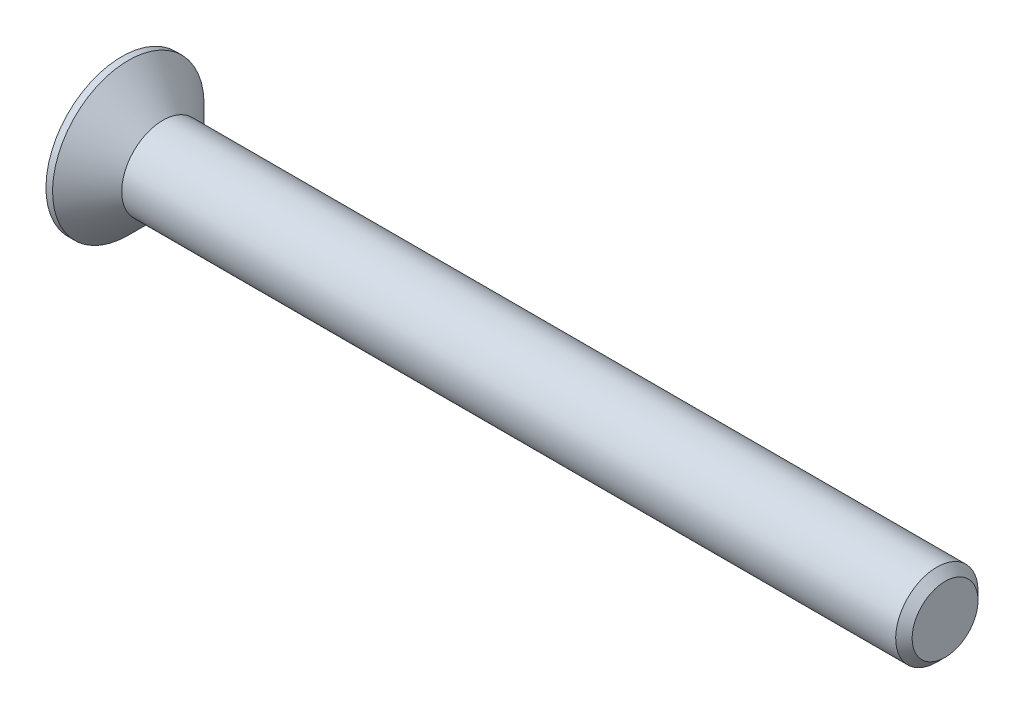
ISO-10303-21;
HEADER;
FILE_DESCRIPTION(('STEP AP214'),'2;1');
FILE_NAME('part.step','',(''),(''),'','','');
FILE_SCHEMA(('AUTOMOTIVE_DESIGN { 1 0 10303 214 1 1 1 1 }'));
ENDSEC;
DATA;
#1=APPLICATION_CONTEXT('core data for automotive mechanical design processes');
#2=APPLICATION_PROTOCOL_DEFINITION('international standard','automotive_design',2000,#1);
#3=PRODUCT_CONTEXT('',#1,'mechanical');
#4=PRODUCT('Part','Part','',(#3));
#5=PRODUCT_RELATED_PRODUCT_CATEGORY('part','',(#4));
#6=PRODUCT_DEFINITION_FORMATION('','',#4);
#7=PRODUCT_DEFINITION_CONTEXT('part definition',#1,'design');
#8=PRODUCT_DEFINITION('design','',#6,#7);
#9=PRODUCT_DEFINITION_SHAPE('','',#8);
#10=(LENGTH_UNIT() NAMED_UNIT(*) SI_UNIT(.MILLI.,.METRE.));
#11=(NAMED_UNIT(*) PLANE_ANGLE_UNIT() SI_UNIT($,.RADIAN.));
#12=(NAMED_UNIT(*) SI_UNIT($,.STERADIAN.) SOLID_ANGLE_UNIT());
#13=UNCERTAINTY_MEASURE_WITH_UNIT(LENGTH_MEASURE(1.E-05),#10,'distance_accuracy_value','');
#14=(GEOMETRIC_REPRESENTATION_CONTEXT(3) GLOBAL_UNCERTAINTY_ASSIGNED_CONTEXT((#13)) GLOBAL_UNIT_ASSIGNED_CONTEXT((#10,
#11,#12)) REPRESENTATION_CONTEXT('',''));
#15=CARTESIAN_POINT('',(0.,0.,0.));
#16=DIRECTION('',(0.,0.,1.));
#17=DIRECTION('',(1.,0.,0.));
#18=AXIS2_PLACEMENT_3D('',#15,#16,#17);
#19=CARTESIAN_POINT('',(0.,0.,0.));
#20=DIRECTION('',(-1.,0.,0.));
#21=DIRECTION('',(0.,-1.,0.));
#22=AXIS2_PLACEMENT_3D('',#19,#20,#21);
#23=CONICAL_SURFACE('',#22,2.5,0.78539816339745);
#24=CARTESIAN_POINT('',(-2.09999999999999,0.,0.));
#25=DIRECTION('',(-1.,0.,0.));
#26=DIRECTION('',(0.,-1.,0.));
#27=AXIS2_PLACEMENT_3D('',#24,#25,#26);
#28=CIRCLE('',#27,4.6);
#29=CARTESIAN_POINT('',(-2.09999999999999,-4.6,0.));
#30=VERTEX_POINT('',#29);
#31=EDGE_CURVE('E189',#30,#30,#28,.T.);
#32=ORIENTED_EDGE('',*,*,#31,.F.);
#33=EDGE_LOOP('',(#32));
#34=FACE_BOUND('',#33,.T.);
#35=CARTESIAN_POINT('',(0.,0.,0.));
#36=DIRECTION('',(-1.,0.,0.));
#37=DIRECTION('',(0.,-1.,0.));
#38=AXIS2_PLACEMENT_3D('',#35,#36,#37);
#39=CIRCLE('',#38,2.5);
#40=CARTESIAN_POINT('',(0.,-2.5,0.));
#41=VERTEX_POINT('',#40);
#42=EDGE_CURVE('E212',#41,#41,#39,.T.);
#43=ORIENTED_EDGE('',*,*,#42,.T.);
#44=EDGE_LOOP('',(#43));
#45=FACE_BOUND('',#44,.T.);
#46=ADVANCED_FACE('F33',(#34,#45),#23,.T.);
#47=CARTESIAN_POINT('',(-2.5,0.,0.));
#48=DIRECTION('',(-1.,0.,0.));
#49=DIRECTION('',(0.,-1.,0.));
#50=AXIS2_PLACEMENT_3D('',#47,#48,#49);
#51=CYLINDRICAL_SURFACE('',#50,2.5);
#52=CARTESIAN_POINT('',(47.,0.,0.));
#53=DIRECTION('',(-1.,0.,0.));
#54=DIRECTION('',(0.,-1.,0.));
#55=AXIS2_PLACEMENT_3D('',#52,#53,#54);
#56=CIRCLE('',#55,2.5);
#57=CARTESIAN_POINT('',(47.,-2.5,0.));
#58=VERTEX_POINT('',#57);
#59=EDGE_CURVE('E41',#58,#58,#56,.T.);
#60=ORIENTED_EDGE('',*,*,#59,.T.);
#61=EDGE_LOOP('',(#60));
#62=FACE_BOUND('',#61,.T.);
#63=ORIENTED_EDGE('',*,*,#42,.F.);
#64=EDGE_LOOP('',(#63));
#65=FACE_BOUND('',#64,.T.);
#66=ADVANCED_FACE('F217',(#62,#65),#51,.T.);
#67=CARTESIAN_POINT('',(47.5,0.,0.));
#68=DIRECTION('',(-1.,0.,0.));
#69=DIRECTION('',(0.,-1.,0.));
#70=AXIS2_PLACEMENT_3D('',#67,#68,#69);
#71=PLANE('',#70);
#72=CARTESIAN_POINT('',(47.5,0.,0.));
#73=DIRECTION('',(-1.,0.,0.));
#74=DIRECTION('',(0.,-1.,0.));
#75=AXIS2_PLACEMENT_3D('',#72,#73,#74);
#76=CIRCLE('',#75,2.00000000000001);
#77=CARTESIAN_POINT('',(47.5,-2.00000000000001,0.));
#78=VERTEX_POINT('',#77);
#79=EDGE_CURVE('E11',#78,#78,#76,.F.);
#80=ORIENTED_EDGE('',*,*,#79,.T.);
#81=EDGE_LOOP('',(#80));
#82=FACE_BOUND('',#81,.T.);
#83=ADVANCED_FACE('F239',(#82),#71,.F.);
#84=CARTESIAN_POINT('',(-2.5,4.6,0.));
#85=DIRECTION('',(1.,0.,0.));
#86=DIRECTION('',(0.,1.,0.));
#87=AXIS2_PLACEMENT_3D('',#84,#85,#86);
#88=PLANE('',#87);
#89=DIRECTION('',(0.,0.,-1.));
#90=VECTOR('',#89,1.);
#91=CARTESIAN_POINT('',(-2.5,0.575,-2.3));
#92=LINE('',#91,#90);
#93=CARTESIAN_POINT('',(-2.5,0.575,-0.575));
#94=VERTEX_POINT('',#93);
#95=CARTESIAN_POINT('',(-2.5,0.575,-2.3));
#96=VERTEX_POINT('',#95);
#97=EDGE_CURVE('E158',#94,#96,#92,.T.);
#98=ORIENTED_EDGE('',*,*,#97,.F.);
#99=DIRECTION('',(0.,-1.,0.));
#100=VECTOR('',#99,1.);
#101=CARTESIAN_POINT('',(-2.5,0.575,-0.575));
#102=LINE('',#101,#100);
#103=CARTESIAN_POINT('',(-2.5,2.3,-0.575));
#104=VERTEX_POINT('',#103);
#105=EDGE_CURVE('E48',#104,#94,#102,.T.);
#106=ORIENTED_EDGE('',*,*,#105,.F.);
#107=DIRECTION('',(0.,0.,-1.));
#108=VECTOR('',#107,1.);
#109=CARTESIAN_POINT('',(-2.5,2.3,-0.575));
#110=LINE('',#109,#108);
#111=CARTESIAN_POINT('',(-2.5,2.3,0.575));
#112=VERTEX_POINT('',#111);
#113=EDGE_CURVE('E185',#112,#104,#110,.T.);
#114=ORIENTED_EDGE('',*,*,#113,.F.);
#115=DIRECTION('',(0.,1.,0.));
#116=VECTOR('',#115,1.);
#117=CARTESIAN_POINT('',(-2.5,2.3,0.575));
#118=LINE('',#117,#116);
#119=CARTESIAN_POINT('',(-2.5,0.575,0.575));
#120=VERTEX_POINT('',#119);
#121=EDGE_CURVE('E183',#120,#112,#118,.T.);
#122=ORIENTED_EDGE('',*,*,#121,.F.);
#123=DIRECTION('',(0.,0.,-1.));
#124=VECTOR('',#123,1.);
#125=CARTESIAN_POINT('',(-2.5,0.575,0.575));
#126=LINE('',#125,#124);
#127=CARTESIAN_POINT('',(-2.5,0.575,2.3));
#128=VERTEX_POINT('',#127);
#129=EDGE_CURVE('E132',#128,#120,#126,.T.);
#130=ORIENTED_EDGE('',*,*,#129,.F.);
#131=DIRECTION('',(0.,1.,0.));
#132=VECTOR('',#131,1.);
#133=CARTESIAN_POINT('',(-2.5,0.575,2.3));
#134=LINE('',#133,#132);
#135=CARTESIAN_POINT('',(-2.5,-0.575,2.3));
#136=VERTEX_POINT('',#135);
#137=EDGE_CURVE('E179',#136,#128,#134,.T.);
#138=ORIENTED_EDGE('',*,*,#137,.F.);
#139=DIRECTION('',(0.,0.,1.));
#140=VECTOR('',#139,1.);
#141=CARTESIAN_POINT('',(-2.5,-0.575,2.3));
#142=LINE('',#141,#140);
#143=CARTESIAN_POINT('',(-2.5,-0.575,0.575));
#144=VERTEX_POINT('',#143);
#145=EDGE_CURVE('E176',#144,#136,#142,.T.);
#146=ORIENTED_EDGE('',*,*,#145,.F.);
#147=DIRECTION('',(0.,1.,0.));
#148=VECTOR('',#147,1.);
#149=CARTESIAN_POINT('',(-2.5,-0.575,0.575));
#150=LINE('',#149,#148);
#151=CARTESIAN_POINT('',(-2.5,-2.3,0.575));
#152=VERTEX_POINT('',#151);
#153=EDGE_CURVE('E173',#152,#144,#150,.T.);
#154=ORIENTED_EDGE('',*,*,#153,.F.);
#155=DIRECTION('',(0.,0.,1.));
#156=VECTOR('',#155,1.);
#157=CARTESIAN_POINT('',(-2.5,-2.3,0.575));
#158=LINE('',#157,#156);
#159=CARTESIAN_POINT('',(-2.5,-2.3,-0.575));
#160=VERTEX_POINT('',#159);
#161=EDGE_CURVE('E170',#160,#152,#158,.T.);
#162=ORIENTED_EDGE('',*,*,#161,.F.);
#163=DIRECTION('',(0.,-1.,0.));
#164=VECTOR('',#163,1.);
#165=CARTESIAN_POINT('',(-2.5,-2.3,-0.575));
#166=LINE('',#165,#164);
#167=CARTESIAN_POINT('',(-2.5,-0.575,-0.575));
#168=VERTEX_POINT('',#167);
#169=EDGE_CURVE('E167',#168,#160,#166,.T.);
#170=ORIENTED_EDGE('',*,*,#169,.F.);
#171=DIRECTION('',(0.,0.,1.));
#172=VECTOR('',#171,1.);
#173=CARTESIAN_POINT('',(-2.5,-0.575,-0.575));
#174=LINE('',#173,#172);
#175=CARTESIAN_POINT('',(-2.5,-0.575,-2.3));
#176=VERTEX_POINT('',#175);
#177=EDGE_CURVE('E164',#176,#168,#174,.T.);
#178=ORIENTED_EDGE('',*,*,#177,.F.);
#179=DIRECTION('',(0.,-1.,0.));
#180=VECTOR('',#179,1.);
#181=CARTESIAN_POINT('',(-2.5,-0.575,-2.3));
#182=LINE('',#181,#180);
#183=EDGE_CURVE('E161',#96,#176,#182,.T.);
#184=ORIENTED_EDGE('',*,*,#183,.F.);
#185=EDGE_LOOP('',(#98,#106,#114,#122,#130,#138,#146,#154,#162,#170,#178,#184));
#186=FACE_BOUND('',#185,.T.);
#187=CARTESIAN_POINT('',(-2.5,0.,0.));
#188=DIRECTION('',(-1.,0.,0.));
#189=DIRECTION('',(0.,-1.,0.));
#190=AXIS2_PLACEMENT_3D('',#187,#188,#189);
#191=CIRCLE('',#190,4.6);
#192=CARTESIAN_POINT('',(-2.5,-4.6,0.));
#193=VERTEX_POINT('',#192);
#194=EDGE_CURVE('E209',#193,#193,#191,.T.);
#195=ORIENTED_EDGE('',*,*,#194,.T.);
#196=EDGE_LOOP('',(#195));
#197=FACE_BOUND('',#196,.T.);
#198=ADVANCED_FACE('F230',(#186,#197),#88,.F.);
#199=CARTESIAN_POINT('',(-2.5,0.,0.));
#200=DIRECTION('',(-1.,0.,0.));
#201=DIRECTION('',(0.,-1.,0.));
#202=AXIS2_PLACEMENT_3D('',#199,#200,#201);
#203=CYLINDRICAL_SURFACE('',#202,4.6);
#204=ORIENTED_EDGE('',*,*,#194,.F.);
#205=EDGE_LOOP('',(#204));
#206=FACE_BOUND('',#205,.T.);
#207=ORIENTED_EDGE('',*,*,#31,.T.);
#208=EDGE_LOOP('',(#207));
#209=FACE_BOUND('',#208,.T.);
#210=ADVANCED_FACE('F222',(#206,#209),#203,.T.);
#211=CARTESIAN_POINT('',(47.,0.,0.));
#212=DIRECTION('',(-1.,0.,0.));
#213=DIRECTION('',(0.,-1.,0.));
#214=AXIS2_PLACEMENT_3D('',#211,#212,#213);
#215=CONICAL_SURFACE('',#214,2.5,0.785398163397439);
#216=ORIENTED_EDGE('',*,*,#79,.F.);
#217=EDGE_LOOP('',(#216));
#218=FACE_BOUND('',#217,.T.);
#219=ORIENTED_EDGE('',*,*,#59,.F.);
#220=EDGE_LOOP('',(#219));
#221=FACE_BOUND('',#220,.T.);
#222=ADVANCED_FACE('F35',(#218,#221),#215,.T.);
#223=CARTESIAN_POINT('',(-0.4,0.575,-0.575));
#224=DIRECTION('',(0.,0.,-1.));
#225=DIRECTION('',(-1.,0.,0.));
#226=AXIS2_PLACEMENT_3D('',#223,#224,#225);
#227=PLANE('',#226);
#228=ORIENTED_EDGE('',*,*,#105,.T.);
#229=DIRECTION('',(-1.,0.,0.));
#230=VECTOR('',#229,1.);
#231=CARTESIAN_POINT('',(-0.4,0.575,-0.575));
#232=LINE('',#231,#230);
#233=CARTESIAN_POINT('',(-0.4,0.575,-0.575));
#234=VERTEX_POINT('',#233);
#235=EDGE_CURVE('E96',#234,#94,#232,.T.);
#236=ORIENTED_EDGE('',*,*,#235,.F.);
#237=DIRECTION('',(0.,-1.,0.));
#238=VECTOR('',#237,1.);
#239=CARTESIAN_POINT('',(-0.4,0.575,-0.575));
#240=LINE('',#239,#238);
#241=CARTESIAN_POINT('',(-0.4,2.3,-0.575));
#242=VERTEX_POINT('',#241);
#243=EDGE_CURVE('E187',#242,#234,#240,.T.);
#244=ORIENTED_EDGE('',*,*,#243,.F.);
#245=DIRECTION('',(-1.,0.,0.));
#246=VECTOR('',#245,1.);
#247=CARTESIAN_POINT('',(-0.4,2.3,-0.575));
#248=LINE('',#247,#246);
#249=EDGE_CURVE('E56',#242,#104,#248,.T.);
#250=ORIENTED_EDGE('',*,*,#249,.T.);
#251=EDGE_LOOP('',(#228,#236,#244,#250));
#252=FACE_BOUND('',#251,.T.);
#253=ADVANCED_FACE('F221',(#252),#227,.F.);
#254=CARTESIAN_POINT('',(-0.4,2.3,-0.575));
#255=DIRECTION('',(0.,1.,0.));
#256=DIRECTION('',(-1.,0.,0.));
#257=AXIS2_PLACEMENT_3D('',#254,#255,#256);
#258=PLANE('',#257);
#259=ORIENTED_EDGE('',*,*,#113,.T.);
#260=ORIENTED_EDGE('',*,*,#249,.F.);
#261=DIRECTION('',(0.,0.,-1.));
#262=VECTOR('',#261,1.);
#263=CARTESIAN_POINT('',(-0.4,2.3,-0.575));
#264=LINE('',#263,#262);
#265=CARTESIAN_POINT('',(-0.4,2.3,0.575));
#266=VERTEX_POINT('',#265);
#267=EDGE_CURVE('E144',#266,#242,#264,.T.);
#268=ORIENTED_EDGE('',*,*,#267,.F.);
#269=DIRECTION('',(-1.,0.,0.));
#270=VECTOR('',#269,1.);
#271=CARTESIAN_POINT('',(-0.4,2.3,0.575));
#272=LINE('',#271,#270);
#273=EDGE_CURVE('E136',#266,#112,#272,.T.);
#274=ORIENTED_EDGE('',*,*,#273,.T.);
#275=EDGE_LOOP('',(#259,#260,#268,#274));
#276=FACE_BOUND('',#275,.T.);
#277=ADVANCED_FACE('F228',(#276),#258,.F.);
#278=CARTESIAN_POINT('',(-0.4,2.3,0.575));
#279=DIRECTION('',(0.,0.,1.));
#280=DIRECTION('',(1.,0.,0.));
#281=AXIS2_PLACEMENT_3D('',#278,#279,#280);
#282=PLANE('',#281);
#283=ORIENTED_EDGE('',*,*,#121,.T.);
#284=ORIENTED_EDGE('',*,*,#273,.F.);
#285=DIRECTION('',(0.,1.,0.));
#286=VECTOR('',#285,1.);
#287=CARTESIAN_POINT('',(-0.4,2.3,0.575));
#288=LINE('',#287,#286);
#289=CARTESIAN_POINT('',(-0.4,0.575,0.575));
#290=VERTEX_POINT('',#289);
#291=EDGE_CURVE('E140',#290,#266,#288,.T.);
#292=ORIENTED_EDGE('',*,*,#291,.F.);
#293=DIRECTION('',(-1.,0.,0.));
#294=VECTOR('',#293,1.);
#295=CARTESIAN_POINT('',(-0.4,0.575,0.575));
#296=LINE('',#295,#294);
#297=EDGE_CURVE('E125',#290,#120,#296,.T.);
#298=ORIENTED_EDGE('',*,*,#297,.T.);
#299=EDGE_LOOP('',(#283,#284,#292,#298));
#300=FACE_BOUND('',#299,.T.);
#301=ADVANCED_FACE('F141',(#300),#282,.F.);
#302=CARTESIAN_POINT('',(-0.4,0.575,0.575));
#303=DIRECTION('',(0.,1.,0.));
#304=DIRECTION('',(-1.,0.,0.));
#305=AXIS2_PLACEMENT_3D('',#302,#303,#304);
#306=PLANE('',#305);
#307=ORIENTED_EDGE('',*,*,#129,.T.);
#308=ORIENTED_EDGE('',*,*,#297,.F.);
#309=DIRECTION('',(0.,0.,-1.));
#310=VECTOR('',#309,1.);
#311=CARTESIAN_POINT('',(-0.4,0.575,0.575));
#312=LINE('',#311,#310);
#313=CARTESIAN_POINT('',(-0.4,0.575,2.3));
#314=VERTEX_POINT('',#313);
#315=EDGE_CURVE('E129',#314,#290,#312,.T.);
#316=ORIENTED_EDGE('',*,*,#315,.F.);
#317=DIRECTION('',(-1.,0.,0.));
#318=VECTOR('',#317,1.);
#319=CARTESIAN_POINT('',(-0.4,0.575,2.3));
#320=LINE('',#319,#318);
#321=EDGE_CURVE('E137',#314,#128,#320,.T.);
#322=ORIENTED_EDGE('',*,*,#321,.T.);
#323=EDGE_LOOP('',(#307,#308,#316,#322));
#324=FACE_BOUND('',#323,.T.);
#325=ADVANCED_FACE('F127',(#324),#306,.F.);
#326=CARTESIAN_POINT('',(-0.4,0.575,2.3));
#327=DIRECTION('',(0.,0.,1.));
#328=DIRECTION('',(1.,0.,0.));
#329=AXIS2_PLACEMENT_3D('',#326,#327,#328);
#330=PLANE('',#329);
#331=ORIENTED_EDGE('',*,*,#137,.T.);
#332=ORIENTED_EDGE('',*,*,#321,.F.);
#333=DIRECTION('',(0.,1.,0.));
#334=VECTOR('',#333,1.);
#335=CARTESIAN_POINT('',(-0.4,0.575,2.3));
#336=LINE('',#335,#334);
#337=CARTESIAN_POINT('',(-0.4,-0.575,2.3));
#338=VERTEX_POINT('',#337);
#339=EDGE_CURVE('E150',#338,#314,#336,.T.);
#340=ORIENTED_EDGE('',*,*,#339,.F.);
#341=DIRECTION('',(-1.,0.,0.));
#342=VECTOR('',#341,1.);
#343=CARTESIAN_POINT('',(-0.4,-0.575,2.3));
#344=LINE('',#343,#342);
#345=EDGE_CURVE('E192',#338,#136,#344,.T.);
#346=ORIENTED_EDGE('',*,*,#345,.T.);
#347=EDGE_LOOP('',(#331,#332,#340,#346));
#348=FACE_BOUND('',#347,.T.);
#349=ADVANCED_FACE('F277',(#348),#330,.F.);
#350=CARTESIAN_POINT('',(-0.4,-0.575,2.3));
#351=DIRECTION('',(0.,-1.,0.));
#352=DIRECTION('',(1.,0.,0.));
#353=AXIS2_PLACEMENT_3D('',#350,#351,#352);
#354=PLANE('',#353);
#355=ORIENTED_EDGE('',*,*,#145,.T.);
#356=ORIENTED_EDGE('',*,*,#345,.F.);
#357=DIRECTION('',(0.,0.,1.));
#358=VECTOR('',#357,1.);
#359=CARTESIAN_POINT('',(-0.4,-0.575,2.3));
#360=LINE('',#359,#358);
#361=CARTESIAN_POINT('',(-0.4,-0.575,0.575));
#362=VERTEX_POINT('',#361);
#363=EDGE_CURVE('E152',#362,#338,#360,.T.);
#364=ORIENTED_EDGE('',*,*,#363,.F.);
#365=DIRECTION('',(-1.,0.,0.));
#366=VECTOR('',#365,1.);
#367=CARTESIAN_POINT('',(-0.4,-0.575,0.575));
#368=LINE('',#367,#366);
#369=EDGE_CURVE('E194',#362,#144,#368,.T.);
#370=ORIENTED_EDGE('',*,*,#369,.T.);
#371=EDGE_LOOP('',(#355,#356,#364,#370));
#372=FACE_BOUND('',#371,.T.);
#373=ADVANCED_FACE('F273',(#372),#354,.F.);
#374=CARTESIAN_POINT('',(-0.4,-0.575,0.575));
#375=DIRECTION('',(0.,0.,1.));
#376=DIRECTION('',(1.,0.,0.));
#377=AXIS2_PLACEMENT_3D('',#374,#375,#376);
#378=PLANE('',#377);
#379=ORIENTED_EDGE('',*,*,#153,.T.);
#380=ORIENTED_EDGE('',*,*,#369,.F.);
#381=DIRECTION('',(0.,1.,0.));
#382=VECTOR('',#381,1.);
#383=CARTESIAN_POINT('',(-0.4,-0.575,0.575));
#384=LINE('',#383,#382);
#385=CARTESIAN_POINT('',(-0.4,-2.3,0.575));
#386=VERTEX_POINT('',#385);
#387=EDGE_CURVE('E422',#386,#362,#384,.T.);
#388=ORIENTED_EDGE('',*,*,#387,.F.);
#389=DIRECTION('',(-1.,0.,0.));
#390=VECTOR('',#389,1.);
#391=CARTESIAN_POINT('',(-0.4,-2.3,0.575));
#392=LINE('',#391,#390);
#393=EDGE_CURVE('E196',#386,#152,#392,.T.);
#394=ORIENTED_EDGE('',*,*,#393,.T.);
#395=EDGE_LOOP('',(#379,#380,#388,#394));
#396=FACE_BOUND('',#395,.T.);
#397=ADVANCED_FACE('F269',(#396),#378,.F.);
#398=CARTESIAN_POINT('',(-0.4,-2.3,0.575));
#399=DIRECTION('',(0.,-1.,0.));
#400=DIRECTION('',(1.,0.,0.));
#401=AXIS2_PLACEMENT_3D('',#398,#399,#400);
#402=PLANE('',#401);
#403=ORIENTED_EDGE('',*,*,#161,.T.);
#404=ORIENTED_EDGE('',*,*,#393,.F.);
#405=DIRECTION('',(0.,0.,1.));
#406=VECTOR('',#405,1.);
#407=CARTESIAN_POINT('',(-0.4,-2.3,0.575));
#408=LINE('',#407,#406);
#409=CARTESIAN_POINT('',(-0.4,-2.3,-0.575));
#410=VERTEX_POINT('',#409);
#411=EDGE_CURVE('E419',#410,#386,#408,.T.);
#412=ORIENTED_EDGE('',*,*,#411,.F.);
#413=DIRECTION('',(-1.,0.,0.));
#414=VECTOR('',#413,1.);
#415=CARTESIAN_POINT('',(-0.4,-2.3,-0.575));
#416=LINE('',#415,#414);
#417=EDGE_CURVE('E198',#410,#160,#416,.T.);
#418=ORIENTED_EDGE('',*,*,#417,.T.);
#419=EDGE_LOOP('',(#403,#404,#412,#418));
#420=FACE_BOUND('',#419,.T.);
#421=ADVANCED_FACE('F265',(#420),#402,.F.);
#422=CARTESIAN_POINT('',(-0.4,-2.3,-0.575));
#423=DIRECTION('',(0.,0.,-1.));
#424=DIRECTION('',(-1.,0.,0.));
#425=AXIS2_PLACEMENT_3D('',#422,#423,#424);
#426=PLANE('',#425);
#427=ORIENTED_EDGE('',*,*,#169,.T.);
#428=ORIENTED_EDGE('',*,*,#417,.F.);
#429=DIRECTION('',(0.,-1.,0.));
#430=VECTOR('',#429,1.);
#431=CARTESIAN_POINT('',(-0.4,-2.3,-0.575));
#432=LINE('',#431,#430);
#433=CARTESIAN_POINT('',(-0.4,-0.575,-0.575));
#434=VERTEX_POINT('',#433);
#435=EDGE_CURVE('E416',#434,#410,#432,.T.);
#436=ORIENTED_EDGE('',*,*,#435,.F.);
#437=DIRECTION('',(-1.,0.,0.));
#438=VECTOR('',#437,1.);
#439=CARTESIAN_POINT('',(-0.4,-0.575,-0.575));
#440=LINE('',#439,#438);
#441=EDGE_CURVE('E200',#434,#168,#440,.T.);
#442=ORIENTED_EDGE('',*,*,#441,.T.);
#443=EDGE_LOOP('',(#427,#428,#436,#442));
#444=FACE_BOUND('',#443,.T.);
#445=ADVANCED_FACE('F261',(#444),#426,.F.);
#446=CARTESIAN_POINT('',(-0.4,-0.575,-0.575));
#447=DIRECTION('',(0.,-1.,0.));
#448=DIRECTION('',(1.,0.,0.));
#449=AXIS2_PLACEMENT_3D('',#446,#447,#448);
#450=PLANE('',#449);
#451=ORIENTED_EDGE('',*,*,#177,.T.);
#452=ORIENTED_EDGE('',*,*,#441,.F.);
#453=DIRECTION('',(0.,0.,1.));
#454=VECTOR('',#453,1.);
#455=CARTESIAN_POINT('',(-0.4,-0.575,-0.575));
#456=LINE('',#455,#454);
#457=CARTESIAN_POINT('',(-0.4,-0.575,-2.3));
#458=VERTEX_POINT('',#457);
#459=EDGE_CURVE('E413',#458,#434,#456,.T.);
#460=ORIENTED_EDGE('',*,*,#459,.F.);
#461=DIRECTION('',(-1.,0.,0.));
#462=VECTOR('',#461,1.);
#463=CARTESIAN_POINT('',(-0.4,-0.575,-2.3));
#464=LINE('',#463,#462);
#465=EDGE_CURVE('E202',#458,#176,#464,.T.);
#466=ORIENTED_EDGE('',*,*,#465,.T.);
#467=EDGE_LOOP('',(#451,#452,#460,#466));
#468=FACE_BOUND('',#467,.T.);
#469=ADVANCED_FACE('F257',(#468),#450,.F.);
#470=CARTESIAN_POINT('',(-0.4,-0.575,-2.3));
#471=DIRECTION('',(0.,0.,-1.));
#472=DIRECTION('',(-1.,0.,0.));
#473=AXIS2_PLACEMENT_3D('',#470,#471,#472);
#474=PLANE('',#473);
#475=ORIENTED_EDGE('',*,*,#183,.T.);
#476=ORIENTED_EDGE('',*,*,#465,.F.);
#477=DIRECTION('',(0.,-1.,0.));
#478=VECTOR('',#477,1.);
#479=CARTESIAN_POINT('',(-0.4,-0.575,-2.3));
#480=LINE('',#479,#478);
#481=CARTESIAN_POINT('',(-0.4,0.575,-2.3));
#482=VERTEX_POINT('',#481);
#483=EDGE_CURVE('E408',#482,#458,#480,.T.);
#484=ORIENTED_EDGE('',*,*,#483,.F.);
#485=DIRECTION('',(-1.,0.,0.));
#486=VECTOR('',#485,1.);
#487=CARTESIAN_POINT('',(-0.4,0.575,-2.3));
#488=LINE('',#487,#486);
#489=EDGE_CURVE('E204',#482,#96,#488,.T.);
#490=ORIENTED_EDGE('',*,*,#489,.T.);
#491=EDGE_LOOP('',(#475,#476,#484,#490));
#492=FACE_BOUND('',#491,.T.);
#493=ADVANCED_FACE('F253',(#492),#474,.F.);
#494=CARTESIAN_POINT('',(-0.4,0.575,-2.3));
#495=DIRECTION('',(0.,1.,0.));
#496=DIRECTION('',(-1.,0.,0.));
#497=AXIS2_PLACEMENT_3D('',#494,#495,#496);
#498=PLANE('',#497);
#499=ORIENTED_EDGE('',*,*,#97,.T.);
#500=ORIENTED_EDGE('',*,*,#489,.F.);
#501=DIRECTION('',(0.,0.,-1.));
#502=VECTOR('',#501,1.);
#503=CARTESIAN_POINT('',(-0.4,0.575,-2.3));
#504=LINE('',#503,#502);
#505=EDGE_CURVE('E406',#234,#482,#504,.T.);
#506=ORIENTED_EDGE('',*,*,#505,.F.);
#507=ORIENTED_EDGE('',*,*,#235,.T.);
#508=EDGE_LOOP('',(#499,#500,#506,#507));
#509=FACE_BOUND('',#508,.T.);
#510=ADVANCED_FACE('F250',(#509),#498,.F.);
#511=CARTESIAN_POINT('',(-0.4,0.,0.));
#512=DIRECTION('',(1.,0.,0.));
#513=DIRECTION('',(0.,0.,-1.));
#514=AXIS2_PLACEMENT_3D('',#511,#512,#513);
#515=PLANE('',#514);
#516=ORIENTED_EDGE('',*,*,#243,.T.);
#517=ORIENTED_EDGE('',*,*,#505,.T.);
#518=ORIENTED_EDGE('',*,*,#483,.T.);
#519=ORIENTED_EDGE('',*,*,#459,.T.);
#520=ORIENTED_EDGE('',*,*,#435,.T.);
#521=ORIENTED_EDGE('',*,*,#411,.T.);
#522=ORIENTED_EDGE('',*,*,#387,.T.);
#523=ORIENTED_EDGE('',*,*,#363,.T.);
#524=ORIENTED_EDGE('',*,*,#339,.T.);
#525=ORIENTED_EDGE('',*,*,#315,.T.);
#526=ORIENTED_EDGE('',*,*,#291,.T.);
#527=ORIENTED_EDGE('',*,*,#267,.T.);
#528=EDGE_LOOP('',(#516,#517,#518,#519,#520,#521,#522,#523,#524,#525,#526,#527));
#529=FACE_BOUND('',#528,.T.);
#530=ADVANCED_FACE('F147',(#529),#515,.F.);
#531=CLOSED_SHELL('',(#46,#66,#83,#198,#210,#222,#253,#277,#301,#325,#349,#373,#397,#421,#445,
#469,#493,#510,#530));
#532=MANIFOLD_SOLID_BREP('B2',#531);
#533=ADVANCED_BREP_SHAPE_REPRESENTATION('',(#18,#532),#14);
#534=SHAPE_DEFINITION_REPRESENTATION(#9,#533);
ENDSEC;
END-ISO-10303-21;
